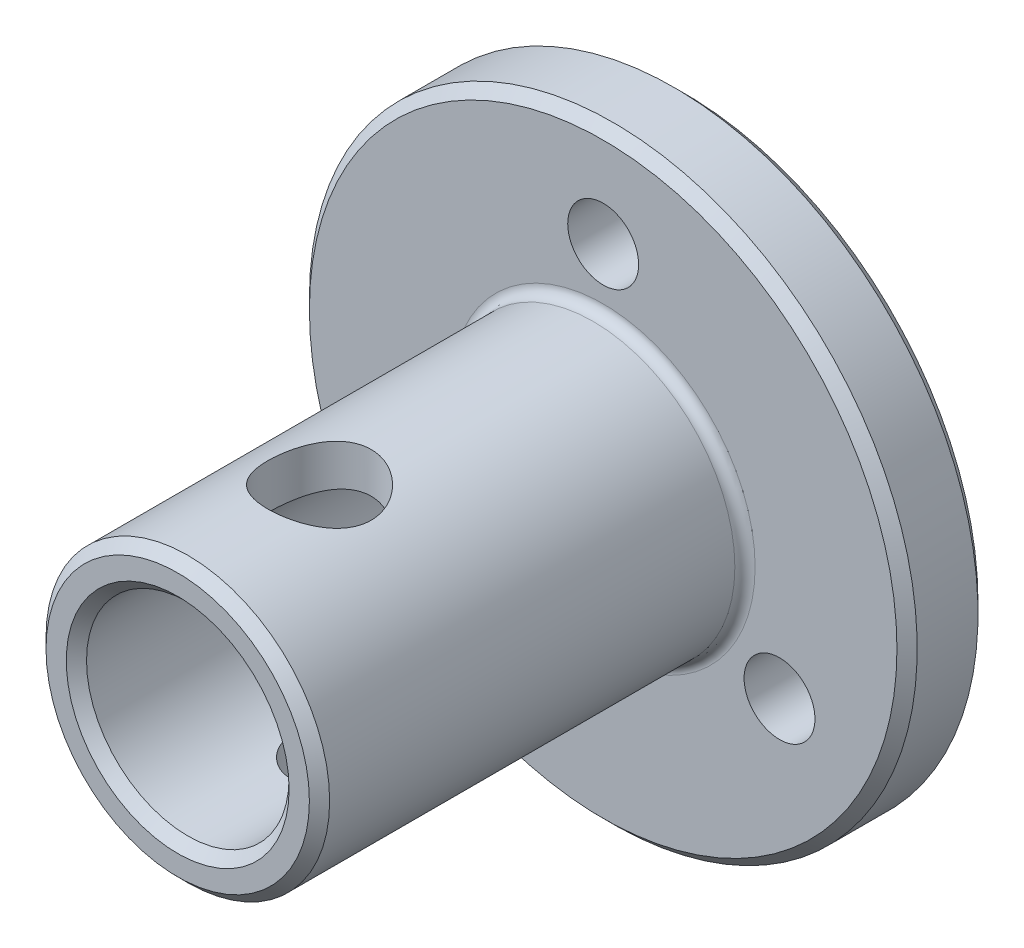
ISO-10303-21;
HEADER;
FILE_DESCRIPTION(('STEP AP214'),'2;1');
FILE_NAME('part.step','',(''),(''),'','','');
FILE_SCHEMA(('AUTOMOTIVE_DESIGN { 1 0 10303 214 1 1 1 1 }'));
ENDSEC;
DATA;
#1=APPLICATION_CONTEXT('core data for automotive mechanical design processes');
#2=APPLICATION_PROTOCOL_DEFINITION('international standard','automotive_design',2000,#1);
#3=PRODUCT_CONTEXT('',#1,'mechanical');
#4=PRODUCT('Part','Part','',(#3));
#5=PRODUCT_RELATED_PRODUCT_CATEGORY('part','',(#4));
#6=PRODUCT_DEFINITION_FORMATION('','',#4);
#7=PRODUCT_DEFINITION_CONTEXT('part definition',#1,'design');
#8=PRODUCT_DEFINITION('design','',#6,#7);
#9=PRODUCT_DEFINITION_SHAPE('','',#8);
#10=(LENGTH_UNIT() NAMED_UNIT(*) SI_UNIT(.MILLI.,.METRE.));
#11=(NAMED_UNIT(*) PLANE_ANGLE_UNIT() SI_UNIT($,.RADIAN.));
#12=(NAMED_UNIT(*) SI_UNIT($,.STERADIAN.) SOLID_ANGLE_UNIT());
#13=UNCERTAINTY_MEASURE_WITH_UNIT(LENGTH_MEASURE(1.E-05),#10,'distance_accuracy_value','');
#14=(GEOMETRIC_REPRESENTATION_CONTEXT(3) GLOBAL_UNCERTAINTY_ASSIGNED_CONTEXT((#13)) GLOBAL_UNIT_ASSIGNED_CONTEXT((#10,
#11,#12)) REPRESENTATION_CONTEXT('',''));
#15=CARTESIAN_POINT('',(0.,0.,0.));
#16=DIRECTION('',(0.,0.,1.));
#17=DIRECTION('',(1.,0.,0.));
#18=AXIS2_PLACEMENT_3D('',#15,#16,#17);
#19=CARTESIAN_POINT('',(0.,0.,42.));
#20=DIRECTION('',(0.,0.,-1.));
#21=DIRECTION('',(-1.,0.,0.));
#22=AXIS2_PLACEMENT_3D('',#19,#20,#21);
#23=CYLINDRICAL_SURFACE('',#22,14.);
#24=CARTESIAN_POINT('',(0.,0.,1.));
#25=DIRECTION('',(0.,0.,-1.));
#26=DIRECTION('',(-1.,0.,0.));
#27=AXIS2_PLACEMENT_3D('',#24,#25,#26);
#28=CIRCLE('',#27,14.);
#29=CARTESIAN_POINT('',(-14.,0.,1.));
#30=VERTEX_POINT('',#29);
#31=EDGE_CURVE('E163',#30,#30,#28,.F.);
#32=ORIENTED_EDGE('',*,*,#31,.T.);
#33=EDGE_LOOP('',(#32));
#34=FACE_BOUND('',#33,.T.);
#35=CARTESIAN_POINT('',(0.,14.,33.1));
#36=CARTESIAN_POINT('',(-0.138343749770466,14.0000003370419,33.1000004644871));
#37=CARTESIAN_POINT('',(-0.276680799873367,13.9979449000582,33.0943665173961));
#38=CARTESIAN_POINT('',(-0.552368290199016,13.9897787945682,33.0718853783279));
#39=CARTESIAN_POINT('',(-0.689718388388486,13.9836667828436,33.0550344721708));
#40=CARTESIAN_POINT('',(-0.962306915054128,13.9675552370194,33.0102927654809));
#41=CARTESIAN_POINT('',(-1.09754630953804,13.9575575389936,32.9824071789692));
#42=CARTESIAN_POINT('',(-1.36507143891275,13.9339378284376,32.9158509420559));
#43=CARTESIAN_POINT('',(-1.49735600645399,13.9203144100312,32.8771761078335));
#44=CARTESIAN_POINT('',(-1.75773259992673,13.8898347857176,32.7894881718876));
#45=CARTESIAN_POINT('',(-1.88583352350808,13.8729860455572,32.7404989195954));
#46=CARTESIAN_POINT('',(-2.1373595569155,13.8364693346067,32.6325431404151));
#47=CARTESIAN_POINT('',(-2.26078291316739,13.8168003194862,32.5735729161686));
#48=CARTESIAN_POINT('',(-2.62284632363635,13.7542885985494,32.3823543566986));
#49=CARTESIAN_POINT('',(-2.85348550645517,13.7079159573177,32.2357283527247));
#50=CARTESIAN_POINT('',(-3.29560951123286,13.6085389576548,31.9023758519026));
#51=CARTESIAN_POINT('',(-3.50609018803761,13.5553545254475,31.7143828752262));
#52=CARTESIAN_POINT('',(-3.89343927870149,13.4492184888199,31.306084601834));
#53=CARTESIAN_POINT('',(-4.07029822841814,13.3962669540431,31.0857702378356));
#54=CARTESIAN_POINT('',(-4.30961917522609,13.3204560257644,30.7310411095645));
#55=CARTESIAN_POINT('',(-4.38615151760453,13.2953868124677,30.6063628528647));
#56=CARTESIAN_POINT('',(-4.52838298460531,13.2476174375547,30.3505590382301));
#57=CARTESIAN_POINT('',(-4.59408643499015,13.2249163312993,30.2194360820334));
#58=CARTESIAN_POINT('',(-4.71411398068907,13.1826092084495,29.9515835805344));
#59=CARTESIAN_POINT('',(-4.76843655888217,13.1630036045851,29.8148532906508));
#60=CARTESIAN_POINT('',(-4.8651625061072,13.1275606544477,29.53682823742));
#61=CARTESIAN_POINT('',(-4.90757153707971,13.1117215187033,29.3955356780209));
#62=CARTESIAN_POINT('',(-4.9786550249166,13.0848913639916,29.1149536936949));
#63=CARTESIAN_POINT('',(-5.0077976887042,13.0737363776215,28.9757985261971));
#64=CARTESIAN_POINT('',(-5.05437706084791,13.0557993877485,28.6953206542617));
#65=CARTESIAN_POINT('',(-5.07181882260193,13.0490154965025,28.5539989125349));
#66=CARTESIAN_POINT('',(-5.09482227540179,13.0400513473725,28.2702636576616));
#67=CARTESIAN_POINT('',(-5.10038547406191,13.0378705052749,28.1278502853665));
#68=CARTESIAN_POINT('',(-5.09957306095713,13.03818835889,27.8430656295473));
#69=CARTESIAN_POINT('',(-5.09319787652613,13.0406868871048,27.7006943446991));
#70=CARTESIAN_POINT('',(-5.06927540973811,13.0500037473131,27.4251200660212));
#71=CARTESIAN_POINT('',(-5.05237650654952,13.0565712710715,27.2918516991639));
#72=CARTESIAN_POINT('',(-5.00817117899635,13.0735909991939,27.0272615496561));
#73=CARTESIAN_POINT('',(-4.98086128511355,13.0840444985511,26.8959404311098));
#74=CARTESIAN_POINT('',(-4.91609102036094,13.1085180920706,26.6361991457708));
#75=CARTESIAN_POINT('',(-4.87863334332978,13.1225372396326,26.5077782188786));
#76=CARTESIAN_POINT('',(-4.7938940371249,13.1537298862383,26.2545970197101));
#77=CARTESIAN_POINT('',(-4.74660864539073,13.1709045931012,26.1298381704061));
#78=CARTESIAN_POINT('',(-4.58868018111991,13.2271201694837,25.7578343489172));
#79=CARTESIAN_POINT('',(-4.46309366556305,13.2704030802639,25.5173763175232));
#80=CARTESIAN_POINT('',(-4.17626438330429,13.3634380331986,25.0603093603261));
#81=CARTESIAN_POINT('',(-4.015009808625,13.4131922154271,24.8437083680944));
#82=CARTESIAN_POINT('',(-3.64936945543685,13.5174115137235,24.4259446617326));
#83=CARTESIAN_POINT('',(-3.442903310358,13.5719757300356,24.2266201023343));
#84=CARTESIAN_POINT('',(-2.99883751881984,13.6769503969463,23.8649050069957));
#85=CARTESIAN_POINT('',(-2.76123361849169,13.7273602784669,23.7025195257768));
#86=CARTESIAN_POINT('',(-2.25715126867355,13.8192515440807,23.4174000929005));
#87=CARTESIAN_POINT('',(-1.99031831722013,13.8605995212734,23.2952467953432));
#88=CARTESIAN_POINT('',(-1.43801260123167,13.9287248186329,23.0981644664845));
#89=CARTESIAN_POINT('',(-1.15254768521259,13.9555082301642,23.0232156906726));
#90=CARTESIAN_POINT('',(-0.586595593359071,13.9904323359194,22.9261325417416));
#91=CARTESIAN_POINT('',(-0.306587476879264,13.9994478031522,22.9015175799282));
#92=CARTESIAN_POINT('',(0.253669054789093,14.000502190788,22.8986196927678));
#93=CARTESIAN_POINT('',(0.533917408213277,13.9925446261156,22.920327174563));
#94=CARTESIAN_POINT('',(1.07619281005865,13.9611248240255,23.007550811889));
#95=CARTESIAN_POINT('',(1.33851294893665,13.9382283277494,23.0714694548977));
#96=CARTESIAN_POINT('',(1.84854217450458,13.87979963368,23.2392230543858));
#97=CARTESIAN_POINT('',(2.09624935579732,13.8442657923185,23.3430632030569));
#98=CARTESIAN_POINT('',(2.57798477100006,13.7628272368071,23.5909788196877));
#99=CARTESIAN_POINT('',(2.811416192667,13.7166540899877,23.7361237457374));
#100=CARTESIAN_POINT('',(3.25135166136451,13.6190889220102,24.0612641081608));
#101=CARTESIAN_POINT('',(3.45784613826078,13.5676950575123,24.2412718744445));
#102=CARTESIAN_POINT('',(3.84994052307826,13.4618512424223,24.6427979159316));
#103=CARTESIAN_POINT('',(4.03378060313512,13.4073878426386,24.8660477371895));
#104=CARTESIAN_POINT('',(4.27959132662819,13.3301354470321,25.2222299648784));
#105=CARTESIAN_POINT('',(4.35657335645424,13.3051116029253,25.3445873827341));
#106=CARTESIAN_POINT('',(4.50002807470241,13.2572793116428,25.5957079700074));
#107=CARTESIAN_POINT('',(4.56650518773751,13.2344699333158,25.7244684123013));
#108=CARTESIAN_POINT('',(4.68857593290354,13.1917192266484,25.987936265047));
#109=CARTESIAN_POINT('',(4.74413957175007,13.1717858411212,26.1226588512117));
#110=CARTESIAN_POINT('',(4.84363717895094,13.1355237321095,26.3967468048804));
#111=CARTESIAN_POINT('',(4.88757605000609,13.1191934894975,26.5361101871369));
#112=CARTESIAN_POINT('',(4.96339846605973,13.090695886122,26.818459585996));
#113=CARTESIAN_POINT('',(4.99528519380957,13.0785274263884,26.9614446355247));
#114=CARTESIAN_POINT('',(5.04666865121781,13.0587861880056,27.2499349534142));
#115=CARTESIAN_POINT('',(5.06616617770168,13.0512131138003,27.3954400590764));
#116=CARTESIAN_POINT('',(5.09174147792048,13.0412554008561,27.678821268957));
#117=CARTESIAN_POINT('',(5.09856642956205,13.0385820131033,27.8166202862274));
#118=CARTESIAN_POINT('',(5.10102765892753,13.0376194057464,28.0923828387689));
#119=CARTESIAN_POINT('',(5.09666015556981,13.0393316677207,28.2303464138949));
#120=CARTESIAN_POINT('',(5.07677853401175,13.0470852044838,28.5052793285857));
#121=CARTESIAN_POINT('',(5.06126955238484,13.0531244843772,28.6422490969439));
#122=CARTESIAN_POINT('',(5.01926481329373,13.0693338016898,28.9142941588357));
#123=CARTESIAN_POINT('',(4.99276492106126,13.0795053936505,29.0493687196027));
#124=CARTESIAN_POINT('',(4.92991530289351,13.1033213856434,29.3129250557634));
#125=CARTESIAN_POINT('',(4.89385773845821,13.1168621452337,29.441485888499));
#126=CARTESIAN_POINT('',(4.811916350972,13.1471426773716,29.6950646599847));
#127=CARTESIAN_POINT('',(4.76602907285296,13.1638835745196,29.8200813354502));
#128=CARTESIAN_POINT('',(4.61415242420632,13.218215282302,30.1886216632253));
#129=CARTESIAN_POINT('',(4.4939002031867,13.2599342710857,30.4258352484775));
#130=CARTESIAN_POINT('',(4.21196042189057,13.352244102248,30.8890666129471));
#131=CARTESIAN_POINT('',(4.04849514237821,13.4031752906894,31.1139237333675));
#132=CARTESIAN_POINT('',(3.68738837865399,13.5069734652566,31.5340914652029));
#133=CARTESIAN_POINT('',(3.48973634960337,13.5598410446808,31.7293929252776));
#134=CARTESIAN_POINT('',(3.16596587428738,13.6378105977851,32.0009887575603));
#135=CARTESIAN_POINT('',(3.05040389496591,13.664184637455,32.0897811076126));
#136=CARTESIAN_POINT('',(2.81186933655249,13.7152556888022,32.2572993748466));
#137=CARTESIAN_POINT('',(2.68889951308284,13.7399533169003,32.3360290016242));
#138=CARTESIAN_POINT('',(2.43626756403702,13.7869909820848,32.4828520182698));
#139=CARTESIAN_POINT('',(2.30660252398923,13.8093299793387,32.5509407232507));
#140=CARTESIAN_POINT('',(2.04154935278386,13.8509949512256,32.6758450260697));
#141=CARTESIAN_POINT('',(1.90616372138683,13.8703222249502,32.7326654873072));
#142=CARTESIAN_POINT('',(1.62780595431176,13.9057658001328,32.8355666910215));
#143=CARTESIAN_POINT('',(1.48473596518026,13.9218096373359,32.8814082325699));
#144=CARTESIAN_POINT('',(1.19478351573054,13.9496843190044,32.9603484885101));
#145=CARTESIAN_POINT('',(1.04790272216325,13.9615169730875,32.9934526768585));
#146=CARTESIAN_POINT('',(0.751517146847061,13.9806033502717,33.0465716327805));
#147=CARTESIAN_POINT('',(0.602012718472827,13.9878576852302,33.0665881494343));
#148=CARTESIAN_POINT('',(0.301669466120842,13.9975556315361,33.0933015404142));
#149=CARTESIAN_POINT('',(0.150830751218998,13.9999996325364,33.099999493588));
#150=CARTESIAN_POINT('',(0.,14.,33.1));
#151=B_SPLINE_CURVE_WITH_KNOTS('',3,(#35,#36,#37,#38,#39,#40,#41,#42,#43,#44,#45,#46,#47,#48,
#49,#50,#51,#52,#53,#54,#55,#56,#57,#58,#59,#60,#61,#62,#63,#64,#65,#66,#67,#68,#69,#70,#71,#72,
#73,#74,#75,#76,#77,#78,#79,#80,#81,#82,#83,#84,#85,#86,#87,#88,#89,#90,#91,#92,#93,#94,#95,#96,
#97,#98,#99,#100,#101,#102,#103,#104,#105,#106,#107,#108,#109,#110,#111,#112,#113,#114,#115,
#116,#117,#118,#119,#120,#121,#122,#123,#124,#125,#126,#127,#128,#129,#130,#131,#132,#133,#134,
#135,#136,#137,#138,#139,#140,#141,#142,#143,#144,#145,#146,#147,#148,#149,#150),.UNSPECIFIED.,
.T.,.F.,(4,2,2,2,2,2,2,2,2,2,2,2,2,2,2,2,2,2,2,2,2,2,2,2,2,2,2,2,2,2,2,2,2,2,2,2,2,2,2,2,2,2,2,
2,2,2,2,2,2,2,2,2,2,2,2,2,2,4),(0.,0.414890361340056,0.829918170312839,1.24475010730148,
1.65974313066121,2.07378692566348,2.48798443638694,3.31573096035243,4.17363827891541,
5.03178673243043,5.47660769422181,5.92125053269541,6.36595260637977,6.8104429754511,
7.23772329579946,7.66481896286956,8.09186042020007,8.5188865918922,8.92190054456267,
9.32504892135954,9.72809038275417,10.13128643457,10.9515386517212,11.7720628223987,
12.6443923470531,13.5168411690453,14.4013799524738,15.2855485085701,16.1249766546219,
16.9642309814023,17.7734151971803,18.5827046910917,19.4152263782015,20.2480430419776,
21.126396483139,21.5660941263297,22.005606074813,22.4463095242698,22.8868268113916,
23.3272276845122,23.7676002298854,24.1810652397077,24.5946699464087,25.0080840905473,
25.4216539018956,25.8238048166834,26.2260973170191,27.0300708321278,27.8744231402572,
28.7190363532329,29.1628969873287,29.6065935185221,30.0504848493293,30.4941841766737,
30.9468146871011,31.3992504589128,31.8516257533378,32.3039644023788),.UNSPECIFIED.);
#152=CARTESIAN_POINT('',(0.,14.,33.1));
#153=VERTEX_POINT('',#152);
#154=EDGE_CURVE('E181',#153,#153,#151,.T.);
#155=ORIENTED_EDGE('',*,*,#154,.T.);
#156=EDGE_LOOP('',(#155));
#157=FACE_BOUND('',#156,.T.);
#158=CARTESIAN_POINT('',(0.,-14.,31.));
#159=CARTESIAN_POINT('',(0.166471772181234,-13.9999969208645,30.9999942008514));
#160=CARTESIAN_POINT('',(0.33301439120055,-13.9970005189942,30.9860967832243));
#161=CARTESIAN_POINT('',(0.661374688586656,-13.9853365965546,30.9309286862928));
#162=CARTESIAN_POINT('',(0.823188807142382,-13.976664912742,30.8896379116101));
#163=CARTESIAN_POINT('',(1.13729864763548,-13.9546166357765,30.7810312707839));
#164=CARTESIAN_POINT('',(1.28960392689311,-13.9412448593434,30.7137420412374));
#165=CARTESIAN_POINT('',(1.58075635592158,-13.9112421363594,30.5551318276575));
#166=CARTESIAN_POINT('',(1.71960396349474,-13.8946113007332,30.4638116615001));
#167=CARTESIAN_POINT('',(1.98204958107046,-13.8596273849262,30.258239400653));
#168=CARTESIAN_POINT('',(2.10541006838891,-13.8412536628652,30.143687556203));
#169=CARTESIAN_POINT('',(2.3313208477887,-13.8050013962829,29.8955473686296));
#170=CARTESIAN_POINT('',(2.43386934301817,-13.7871228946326,29.7619573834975));
#171=CARTESIAN_POINT('',(2.61628408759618,-13.7536823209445,29.4777884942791));
#172=CARTESIAN_POINT('',(2.69589916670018,-13.7381467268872,29.3270449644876));
#173=CARTESIAN_POINT('',(2.82857647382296,-13.7114465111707,29.0139310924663));
#174=CARTESIAN_POINT('',(2.88164174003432,-13.7002813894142,28.8515620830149));
#175=CARTESIAN_POINT('',(2.9589314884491,-13.6837961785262,28.5223778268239));
#176=CARTESIAN_POINT('',(2.98357559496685,-13.6783911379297,28.3556654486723));
#177=CARTESIAN_POINT('',(3.00462790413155,-13.6737827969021,28.020391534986));
#178=CARTESIAN_POINT('',(3.00103943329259,-13.6745787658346,27.8518302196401));
#179=CARTESIAN_POINT('',(2.96606652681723,-13.6822055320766,27.5207506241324));
#180=CARTESIAN_POINT('',(2.93516797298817,-13.6889308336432,27.3581782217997));
#181=CARTESIAN_POINT('',(2.84722108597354,-13.7074918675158,27.0405795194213));
#182=CARTESIAN_POINT('',(2.79017133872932,-13.719327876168,26.8855536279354));
#183=CARTESIAN_POINT('',(2.65109102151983,-13.7468816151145,26.5860742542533));
#184=CARTESIAN_POINT('',(2.5688722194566,-13.7626284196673,26.4417109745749));
#185=CARTESIAN_POINT('',(2.38192014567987,-13.7962114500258,26.1686496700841));
#186=CARTESIAN_POINT('',(2.27718392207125,-13.8140479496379,26.0399537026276));
#187=CARTESIAN_POINT('',(2.04559085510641,-13.8502543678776,25.7990812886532));
#188=CARTESIAN_POINT('',(1.91832046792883,-13.8686276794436,25.6873025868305));
#189=CARTESIAN_POINT('',(1.6466346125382,-13.9035003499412,25.4866125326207));
#190=CARTESIAN_POINT('',(1.50221885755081,-13.9199996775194,25.3977015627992));
#191=CARTESIAN_POINT('',(1.19986692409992,-13.9493155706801,25.2451786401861));
#192=CARTESIAN_POINT('',(1.04190451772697,-13.9621247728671,25.181617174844));
#193=CARTESIAN_POINT('',(0.717206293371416,-13.9825621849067,25.0820487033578));
#194=CARTESIAN_POINT('',(0.55047170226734,-13.9901911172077,25.0460378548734));
#195=CARTESIAN_POINT('',(0.216375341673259,-13.9993061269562,25.0031675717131));
#196=CARTESIAN_POINT('',(0.0490863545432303,-14.0009067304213,24.9957645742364));
#197=CARTESIAN_POINT('',(-0.284337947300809,-13.9981049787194,25.0088491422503));
#198=CARTESIAN_POINT('',(-0.45047333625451,-13.993703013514,25.0293348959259));
#199=CARTESIAN_POINT('',(-0.775085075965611,-13.9794628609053,25.0971644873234));
#200=CARTESIAN_POINT('',(-0.933623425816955,-13.9696821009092,25.1442247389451));
#201=CARTESIAN_POINT('',(-1.24055690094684,-13.9457784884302,25.2635538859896));
#202=CARTESIAN_POINT('',(-1.38895118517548,-13.9316552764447,25.3358248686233));
#203=CARTESIAN_POINT('',(-1.67364279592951,-13.900350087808,25.5046670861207));
#204=CARTESIAN_POINT('',(-1.80974515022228,-13.8831286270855,25.6015595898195));
#205=CARTESIAN_POINT('',(-2.0639538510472,-13.8476206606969,25.8164696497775));
#206=CARTESIAN_POINT('',(-2.182057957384,-13.8293340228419,25.9344898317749));
#207=CARTESIAN_POINT('',(-2.39905422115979,-13.7933634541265,26.1907947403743));
#208=CARTESIAN_POINT('',(-2.49757074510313,-13.7756958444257,26.3294001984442));
#209=CARTESIAN_POINT('',(-2.66992830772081,-13.7433330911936,26.621509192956));
#210=CARTESIAN_POINT('',(-2.74377039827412,-13.7286378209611,26.775012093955));
#211=CARTESIAN_POINT('',(-2.86419482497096,-13.7040201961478,27.0917445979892));
#212=CARTESIAN_POINT('',(-2.91092797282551,-13.6940714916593,27.2549147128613));
#213=CARTESIAN_POINT('',(-2.97625392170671,-13.6800237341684,27.5870311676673));
#214=CARTESIAN_POINT('',(-2.99485101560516,-13.6759237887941,27.7559766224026));
#215=CARTESIAN_POINT('',(-3.00319999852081,-13.6740923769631,28.0910646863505));
#216=CARTESIAN_POINT('',(-2.99354694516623,-13.6762295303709,28.2571920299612));
#217=CARTESIAN_POINT('',(-2.94699578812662,-13.6863352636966,28.5853944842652));
#218=CARTESIAN_POINT('',(-2.91009797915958,-13.6943037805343,28.7474696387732));
#219=CARTESIAN_POINT('',(-2.81038691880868,-13.7151116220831,29.0625173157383));
#220=CARTESIAN_POINT('',(-2.74765694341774,-13.7279352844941,29.2155172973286));
#221=CARTESIAN_POINT('',(-2.59813503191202,-13.757015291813,29.5089107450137));
#222=CARTESIAN_POINT('',(-2.51134070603,-13.7732719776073,29.6493029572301));
#223=CARTESIAN_POINT('',(-2.31416580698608,-13.8077811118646,29.9164363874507));
#224=CARTESIAN_POINT('',(-2.20335974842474,-13.8260661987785,30.042859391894));
#225=CARTESIAN_POINT('',(-1.96217310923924,-13.8623489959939,30.2755125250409));
#226=CARTESIAN_POINT('',(-1.8317880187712,-13.8803466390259,30.3817379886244));
#227=CARTESIAN_POINT('',(-1.55320629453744,-13.9142898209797,30.5722319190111));
#228=CARTESIAN_POINT('',(-1.40480969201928,-13.9302072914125,30.656213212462));
#229=CARTESIAN_POINT('',(-1.0957003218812,-13.9579165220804,30.7979090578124));
#230=CARTESIAN_POINT('',(-0.934998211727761,-13.9697118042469,30.8556460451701));
#231=CARTESIAN_POINT('',(-0.645070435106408,-13.9856969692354,30.9327043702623));
#232=CARTESIAN_POINT('',(-0.517434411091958,-13.9910278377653,30.9578928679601));
#233=CARTESIAN_POINT('',(-0.259879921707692,-13.9981804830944,30.9915426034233));
#234=CARTESIAN_POINT('',(-0.129961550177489,-14.0000024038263,31.0000045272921));
#235=CARTESIAN_POINT('',(0.,-14.,31.));
#236=B_SPLINE_CURVE_WITH_KNOTS('',3,(#158,#159,#160,#161,#162,#163,#164,#165,#166,#167,#168,
#169,#170,#171,#172,#173,#174,#175,#176,#177,#178,#179,#180,#181,#182,#183,#184,#185,#186,#187,
#188,#189,#190,#191,#192,#193,#194,#195,#196,#197,#198,#199,#200,#201,#202,#203,#204,#205,#206,
#207,#208,#209,#210,#211,#212,#213,#214,#215,#216,#217,#218,#219,#220,#221,#222,#223,#224,#225,
#226,#227,#228,#229,#230,#231,#232,#233,#234,#235),.UNSPECIFIED.,.T.,.F.,(4,2,2,2,2,2,2,2,2,2,2,
2,2,2,2,2,2,2,2,2,2,2,2,2,2,2,2,2,2,2,2,2,2,2,2,2,2,2,4),(0.,0.498939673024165,
0.998245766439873,1.49704164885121,1.99582055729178,2.50149923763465,3.00722155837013,
3.51828858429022,4.0292971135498,4.53266016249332,5.03596390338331,5.53048950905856,
6.02504185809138,6.52338712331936,7.0217977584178,7.53054022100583,8.03929119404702,
8.54905042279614,9.05873854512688,9.55869331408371,10.0586156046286,10.5533012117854,
11.0480277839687,11.5495746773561,12.0511839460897,12.5616412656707,13.0720768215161,
13.5796448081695,14.0871353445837,14.5840136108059,15.0808865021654,15.5761699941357,
16.0715026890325,16.5764590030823,17.0815318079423,17.5928382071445,18.1037066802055,
18.4932359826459,18.8827493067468),.UNSPECIFIED.);
#237=CARTESIAN_POINT('',(0.,-14.,31.));
#238=VERTEX_POINT('',#237);
#239=EDGE_CURVE('E182',#238,#238,#236,.T.);
#240=ORIENTED_EDGE('',*,*,#239,.T.);
#241=EDGE_LOOP('',(#240));
#242=FACE_BOUND('',#241,.T.);
#243=CARTESIAN_POINT('',(0.,0.,41.));
#244=DIRECTION('',(0.,0.,1.));
#245=DIRECTION('',(1.,0.,0.));
#246=AXIS2_PLACEMENT_3D('',#243,#244,#245);
#247=CIRCLE('',#246,14.);
#248=CARTESIAN_POINT('',(14.,0.,41.));
#249=VERTEX_POINT('',#248);
#250=EDGE_CURVE('E245',#249,#249,#247,.F.);
#251=ORIENTED_EDGE('',*,*,#250,.T.);
#252=EDGE_LOOP('',(#251));
#253=FACE_BOUND('',#252,.T.);
#254=ADVANCED_FACE('F156',(#34,#157,#242,#253),#23,.T.);
#255=CARTESIAN_POINT('',(0.,0.,42.));
#256=DIRECTION('',(0.,0.,1.));
#257=DIRECTION('',(1.,0.,0.));
#258=AXIS2_PLACEMENT_3D('',#255,#256,#257);
#259=PLANE('',#258);
#260=CARTESIAN_POINT('',(0.,0.,42.));
#261=DIRECTION('',(0.,0.,1.));
#262=DIRECTION('',(1.,0.,0.));
#263=AXIS2_PLACEMENT_3D('',#260,#261,#262);
#264=CIRCLE('',#263,13.);
#265=CARTESIAN_POINT('',(13.,0.,42.));
#266=VERTEX_POINT('',#265);
#267=EDGE_CURVE('E242',#266,#266,#264,.T.);
#268=ORIENTED_EDGE('',*,*,#267,.T.);
#269=EDGE_LOOP('',(#268));
#270=FACE_BOUND('',#269,.T.);
#271=CARTESIAN_POINT('',(0.,0.,42.));
#272=DIRECTION('',(0.,0.,1.));
#273=DIRECTION('',(1.,0.,0.));
#274=AXIS2_PLACEMENT_3D('',#271,#272,#273);
#275=CIRCLE('',#274,11.);
#276=CARTESIAN_POINT('',(11.,0.,42.));
#277=VERTEX_POINT('',#276);
#278=EDGE_CURVE('E236',#277,#277,#275,.F.);
#279=ORIENTED_EDGE('',*,*,#278,.T.);
#280=EDGE_LOOP('',(#279));
#281=FACE_BOUND('',#280,.T.);
#282=ADVANCED_FACE('F270',(#270,#281),#259,.T.);
#283=CARTESIAN_POINT('',(0.,0.,-8.));
#284=DIRECTION('',(0.,0.,1.));
#285=DIRECTION('',(1.,0.,0.));
#286=AXIS2_PLACEMENT_3D('',#283,#284,#285);
#287=CYLINDRICAL_SURFACE('',#286,30.);
#288=CARTESIAN_POINT('',(0.,0.,-1.00000000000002));
#289=DIRECTION('',(0.,0.,-1.));
#290=DIRECTION('',(-1.,0.,0.));
#291=AXIS2_PLACEMENT_3D('',#288,#289,#290);
#292=CIRCLE('',#291,30.);
#293=CARTESIAN_POINT('',(-30.,0.,-1.00000000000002));
#294=VERTEX_POINT('',#293);
#295=EDGE_CURVE('E171',#294,#294,#292,.T.);
#296=ORIENTED_EDGE('',*,*,#295,.T.);
#297=EDGE_LOOP('',(#296));
#298=FACE_BOUND('',#297,.T.);
#299=CARTESIAN_POINT('',(0.,0.,-6.99999999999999));
#300=DIRECTION('',(0.,0.,-1.));
#301=DIRECTION('',(-1.,0.,0.));
#302=AXIS2_PLACEMENT_3D('',#299,#300,#301);
#303=CIRCLE('',#302,30.);
#304=CARTESIAN_POINT('',(-30.,0.,-6.99999999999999));
#305=VERTEX_POINT('',#304);
#306=EDGE_CURVE('E239',#305,#305,#303,.F.);
#307=ORIENTED_EDGE('',*,*,#306,.T.);
#308=EDGE_LOOP('',(#307));
#309=FACE_BOUND('',#308,.T.);
#310=ADVANCED_FACE('F274',(#298,#309),#287,.T.);
#311=CARTESIAN_POINT('',(0.,0.,-8.));
#312=DIRECTION('',(0.,0.,-1.));
#313=DIRECTION('',(-1.,0.,0.));
#314=AXIS2_PLACEMENT_3D('',#311,#312,#313);
#315=PLANE('',#314);
#316=CARTESIAN_POINT('',(-17.4071106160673,-10.0499999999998,-8.));
#317=DIRECTION('',(0.,0.,-1.));
#318=DIRECTION('',(0.499999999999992,-0.866025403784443,0.));
#319=AXIS2_PLACEMENT_3D('',#316,#317,#318);
#320=CIRCLE('',#319,3.5);
#321=CARTESIAN_POINT('',(-15.6571106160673,-13.0810889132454,-8.));
#322=VERTEX_POINT('',#321);
#323=EDGE_CURVE('E210',#322,#322,#320,.T.);
#324=ORIENTED_EDGE('',*,*,#323,.F.);
#325=EDGE_LOOP('',(#324));
#326=FACE_BOUND('',#325,.T.);
#327=CARTESIAN_POINT('',(17.4071106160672,-10.0500000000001,-8.));
#328=DIRECTION('',(0.,0.,-1.));
#329=DIRECTION('',(0.500000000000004,0.866025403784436,0.));
#330=AXIS2_PLACEMENT_3D('',#327,#328,#329);
#331=CIRCLE('',#330,3.5);
#332=CARTESIAN_POINT('',(19.1571106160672,-7.01891108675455,-8.));
#333=VERTEX_POINT('',#332);
#334=EDGE_CURVE('E216',#333,#333,#331,.T.);
#335=ORIENTED_EDGE('',*,*,#334,.F.);
#336=EDGE_LOOP('',(#335));
#337=FACE_BOUND('',#336,.T.);
#338=CARTESIAN_POINT('',(0.,20.1,-8.));
#339=DIRECTION('',(0.,0.,-1.));
#340=DIRECTION('',(-1.,0.,0.));
#341=AXIS2_PLACEMENT_3D('',#338,#339,#340);
#342=CIRCLE('',#341,3.5);
#343=CARTESIAN_POINT('',(-3.5,20.1,-8.));
#344=VERTEX_POINT('',#343);
#345=EDGE_CURVE('E220',#344,#344,#342,.T.);
#346=ORIENTED_EDGE('',*,*,#345,.F.);
#347=EDGE_LOOP('',(#346));
#348=FACE_BOUND('',#347,.T.);
#349=CARTESIAN_POINT('',(0.,0.,-8.));
#350=DIRECTION('',(0.,0.,-1.));
#351=DIRECTION('',(-1.,0.,0.));
#352=AXIS2_PLACEMENT_3D('',#349,#350,#351);
#353=CIRCLE('',#352,11.);
#354=CARTESIAN_POINT('',(-11.,0.,-8.));
#355=VERTEX_POINT('',#354);
#356=EDGE_CURVE('E233',#355,#355,#353,.F.);
#357=ORIENTED_EDGE('',*,*,#356,.T.);
#358=EDGE_LOOP('',(#357));
#359=FACE_BOUND('',#358,.T.);
#360=CARTESIAN_POINT('',(0.,0.,-8.));
#361=DIRECTION('',(0.,0.,-1.));
#362=DIRECTION('',(-1.,0.,0.));
#363=AXIS2_PLACEMENT_3D('',#360,#361,#362);
#364=CIRCLE('',#363,29.);
#365=CARTESIAN_POINT('',(-29.,0.,-8.));
#366=VERTEX_POINT('',#365);
#367=EDGE_CURVE('E230',#366,#366,#364,.T.);
#368=ORIENTED_EDGE('',*,*,#367,.T.);
#369=EDGE_LOOP('',(#368));
#370=FACE_BOUND('',#369,.T.);
#371=ADVANCED_FACE('F321',(#326,#337,#348,#359,#370),#315,.T.);
#372=CARTESIAN_POINT('',(0.,0.,0.));
#373=DIRECTION('',(0.,0.,-1.));
#374=DIRECTION('',(-1.,0.,0.));
#375=AXIS2_PLACEMENT_3D('',#372,#373,#374);
#376=PLANE('',#375);
#377=CARTESIAN_POINT('',(0.,0.,0.));
#378=DIRECTION('',(0.,0.,-1.));
#379=DIRECTION('',(-1.,0.,0.));
#380=AXIS2_PLACEMENT_3D('',#377,#378,#379);
#381=CIRCLE('',#380,15.);
#382=CARTESIAN_POINT('',(-15.,0.,0.));
#383=VERTEX_POINT('',#382);
#384=EDGE_CURVE('E11',#383,#383,#381,.T.);
#385=ORIENTED_EDGE('',*,*,#384,.T.);
#386=EDGE_LOOP('',(#385));
#387=FACE_BOUND('',#386,.T.);
#388=CARTESIAN_POINT('',(-17.4071106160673,-10.0499999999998,0.));
#389=DIRECTION('',(0.,0.,-1.));
#390=DIRECTION('',(-1.,0.,0.));
#391=AXIS2_PLACEMENT_3D('',#388,#389,#390);
#392=CIRCLE('',#391,3.5);
#393=CARTESIAN_POINT('',(-20.9071106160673,-10.0499999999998,0.));
#394=VERTEX_POINT('',#393);
#395=EDGE_CURVE('E215',#394,#394,#392,.T.);
#396=ORIENTED_EDGE('',*,*,#395,.T.);
#397=EDGE_LOOP('',(#396));
#398=FACE_BOUND('',#397,.T.);
#399=CARTESIAN_POINT('',(17.4071106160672,-10.0500000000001,0.));
#400=DIRECTION('',(0.,0.,-1.));
#401=DIRECTION('',(-1.,0.,0.));
#402=AXIS2_PLACEMENT_3D('',#399,#400,#401);
#403=CIRCLE('',#402,3.5);
#404=CARTESIAN_POINT('',(13.9071106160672,-10.0500000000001,0.));
#405=VERTEX_POINT('',#404);
#406=EDGE_CURVE('E219',#405,#405,#403,.T.);
#407=ORIENTED_EDGE('',*,*,#406,.T.);
#408=EDGE_LOOP('',(#407));
#409=FACE_BOUND('',#408,.T.);
#410=CARTESIAN_POINT('',(0.,20.1,0.));
#411=DIRECTION('',(0.,0.,-1.));
#412=DIRECTION('',(-1.,0.,0.));
#413=AXIS2_PLACEMENT_3D('',#410,#411,#412);
#414=CIRCLE('',#413,3.5);
#415=CARTESIAN_POINT('',(-3.5,20.1,0.));
#416=VERTEX_POINT('',#415);
#417=EDGE_CURVE('E223',#416,#416,#414,.T.);
#418=ORIENTED_EDGE('',*,*,#417,.T.);
#419=EDGE_LOOP('',(#418));
#420=FACE_BOUND('',#419,.T.);
#421=CARTESIAN_POINT('',(0.,0.,0.));
#422=DIRECTION('',(0.,0.,-1.));
#423=DIRECTION('',(-1.,0.,0.));
#424=AXIS2_PLACEMENT_3D('',#421,#422,#423);
#425=CIRCLE('',#424,29.);
#426=CARTESIAN_POINT('',(-29.,0.,0.));
#427=VERTEX_POINT('',#426);
#428=EDGE_CURVE('E167',#427,#427,#425,.F.);
#429=ORIENTED_EDGE('',*,*,#428,.T.);
#430=EDGE_LOOP('',(#429));
#431=FACE_BOUND('',#430,.T.);
#432=ADVANCED_FACE('F256',(#387,#398,#409,#420,#431),#376,.F.);
#433=CARTESIAN_POINT('',(0.,0.,42.));
#434=DIRECTION('',(0.,0.,-1.));
#435=DIRECTION('',(-1.,0.,0.));
#436=AXIS2_PLACEMENT_3D('',#433,#434,#435);
#437=CYLINDRICAL_SURFACE('',#436,10.);
#438=CARTESIAN_POINT('',(0.,10.,33.1));
#439=CARTESIAN_POINT('',(0.133793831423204,9.99999980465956,33.0999998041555));
#440=CARTESIAN_POINT('',(0.267592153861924,9.99730878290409,33.0947291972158));
#441=CARTESIAN_POINT('',(0.534199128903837,9.9866130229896,33.0737087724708));
#442=CARTESIAN_POINT('',(0.6670073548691,9.97860611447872,33.0579546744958));
#443=CARTESIAN_POINT('',(0.930755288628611,9.95747059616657,33.0161286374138));
#444=CARTESIAN_POINT('',(1.06169225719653,9.94433514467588,32.9900429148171));
#445=CARTESIAN_POINT('',(1.32063120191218,9.91327133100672,32.9278467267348));
#446=CARTESIAN_POINT('',(1.44863195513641,9.89534100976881,32.8917321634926));
#447=CARTESIAN_POINT('',(1.7002554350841,9.85521616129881,32.8100464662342));
#448=CARTESIAN_POINT('',(1.8238949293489,9.83304071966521,32.7645175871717));
#449=CARTESIAN_POINT('',(2.06667845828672,9.78489593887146,32.6643444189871));
#450=CARTESIAN_POINT('',(2.18582077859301,9.75892517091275,32.6096966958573));
#451=CARTESIAN_POINT('',(2.53539554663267,9.67620451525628,32.4328166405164));
#452=CARTESIAN_POINT('',(2.75824625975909,9.61460123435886,32.2975586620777));
#453=CARTESIAN_POINT('',(3.19236440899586,9.47965013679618,31.9867942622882));
#454=CARTESIAN_POINT('',(3.40204917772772,9.40581014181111,31.8093076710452));
#455=CARTESIAN_POINT('',(3.79015487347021,9.25624228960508,31.4234097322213));
#456=CARTESIAN_POINT('',(3.96855093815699,9.18051298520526,31.2149740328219));
#457=CARTESIAN_POINT('',(4.30366061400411,9.02857070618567,30.7525202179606));
#458=CARTESIAN_POINT('',(4.45742168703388,8.95282143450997,30.4961715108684));
#459=CARTESIAN_POINT('',(4.65352994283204,8.8515584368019,30.0921630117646));
#460=CARTESIAN_POINT('',(4.71315792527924,8.81985574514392,29.9541966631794));
#461=CARTESIAN_POINT('',(4.82028187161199,8.7617689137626,29.6725823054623));
#462=CARTESIAN_POINT('',(4.86778514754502,8.73538157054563,29.5289377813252));
#463=CARTESIAN_POINT('',(4.94754661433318,8.69044036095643,29.2458315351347));
#464=CARTESIAN_POINT('',(4.9805510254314,8.67151024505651,29.106639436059));
#465=CARTESIAN_POINT('',(5.03481223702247,8.64011875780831,28.825328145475));
#466=CARTESIAN_POINT('',(5.05607539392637,8.62765388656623,28.6832105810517));
#467=CARTESIAN_POINT('',(5.08652827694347,8.60973543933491,28.3973405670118));
#468=CARTESIAN_POINT('',(5.09572598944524,8.6042772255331,28.2535892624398));
#469=CARTESIAN_POINT('',(5.10191567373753,8.60060883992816,27.9657381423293));
#470=CARTESIAN_POINT('',(5.09890889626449,8.60239792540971,27.8216383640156));
#471=CARTESIAN_POINT('',(5.08189398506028,8.61245778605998,27.5525988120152));
#472=CARTESIAN_POINT('',(5.06932020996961,8.61988319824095,27.4275332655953));
#473=CARTESIAN_POINT('',(5.03505362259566,8.63994384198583,27.1790430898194));
#474=CARTESIAN_POINT('',(5.01335796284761,8.65258070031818,27.0556189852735));
#475=CARTESIAN_POINT('',(4.96110189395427,8.68264789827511,26.8112728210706));
#476=CARTESIAN_POINT('',(4.93054240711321,8.70007773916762,26.6903505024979));
#477=CARTESIAN_POINT('',(4.86088255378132,8.73918822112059,26.4516786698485));
#478=CARTESIAN_POINT('',(4.8217788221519,8.76087053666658,26.3339304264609));
#479=CARTESIAN_POINT('',(4.69020336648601,8.83244839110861,25.9811280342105));
#480=CARTESIAN_POINT('',(4.58464459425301,8.8881610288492,25.7519835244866));
#481=CARTESIAN_POINT('',(4.34239959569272,9.00898628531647,25.3136591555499));
#482=CARTESIAN_POINT('',(4.20569937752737,9.07410312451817,25.1044883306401));
#483=CARTESIAN_POINT('',(3.8839296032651,9.21683395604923,24.6827033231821));
#484=CARTESIAN_POINT('',(3.69484948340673,9.29495999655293,24.4733118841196));
#485=CARTESIAN_POINT('',(3.28386524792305,9.44797308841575,24.0877674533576));
#486=CARTESIAN_POINT('',(3.0619443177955,9.52285845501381,23.9116315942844));
#487=CARTESIAN_POINT('',(2.70198547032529,9.62891878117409,23.6720083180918));
#488=CARTESIAN_POINT('',(2.57408511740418,9.66397937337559,23.5947152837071));
#489=CARTESIAN_POINT('',(2.31122235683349,9.73018910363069,23.451303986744));
#490=CARTESIAN_POINT('',(2.17626296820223,9.76133989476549,23.3851809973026));
#491=CARTESIAN_POINT('',(1.90022060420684,9.81881030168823,23.2648306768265));
#492=CARTESIAN_POINT('',(1.7591402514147,9.84513196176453,23.2105983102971));
#493=CARTESIAN_POINT('',(1.47187264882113,9.89215649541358,23.1146636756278));
#494=CARTESIAN_POINT('',(1.32568601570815,9.91286004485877,23.072959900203));
#495=CARTESIAN_POINT('',(1.04205474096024,9.94649450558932,23.0056505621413));
#496=CARTESIAN_POINT('',(0.904923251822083,9.95993651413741,22.9789779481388));
#497=CARTESIAN_POINT('',(0.628510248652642,9.98119138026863,22.9369464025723));
#498=CARTESIAN_POINT('',(0.489228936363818,9.98900476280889,22.9215864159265));
#499=CARTESIAN_POINT('',(0.209726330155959,9.99877804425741,22.9023897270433));
#500=CARTESIAN_POINT('',(0.0695054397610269,10.0007403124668,22.898548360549));
#501=CARTESIAN_POINT('',(-0.210730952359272,9.99876106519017,22.9024293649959));
#502=CARTESIAN_POINT('',(-0.35074646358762,9.99481983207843,22.9101511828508));
#503=CARTESIAN_POINT('',(-0.617995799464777,9.98170806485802,22.935949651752));
#504=CARTESIAN_POINT('',(-0.745339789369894,9.97299078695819,22.9531293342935));
#505=CARTESIAN_POINT('',(-0.998014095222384,9.95088226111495,22.9969593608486));
#506=CARTESIAN_POINT('',(-1.12334376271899,9.93748953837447,23.0236126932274));
#507=CARTESIAN_POINT('',(-1.37109847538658,9.90634471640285,23.0861012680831));
#508=CARTESIAN_POINT('',(-1.49352440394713,9.88859396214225,23.1219336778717));
#509=CARTESIAN_POINT('',(-1.73479856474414,9.84913465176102,23.2024303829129));
#510=CARTESIAN_POINT('',(-1.85364540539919,9.8274245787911,23.2470980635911));
#511=CARTESIAN_POINT('',(-2.21016905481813,9.75575598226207,23.3964556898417));
#512=CARTESIAN_POINT('',(-2.44115664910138,9.70012931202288,23.5148111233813));
#513=CARTESIAN_POINT('',(-2.88061156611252,9.57884325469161,23.7835348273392));
#514=CARTESIAN_POINT('',(-3.08906943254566,9.51317968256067,23.9339164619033));
#515=CARTESIAN_POINT('',(-3.50007272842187,9.37024254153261,24.2799500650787));
#516=CARTESIAN_POINT('',(-3.6998868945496,9.29246646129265,24.4786426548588));
#517=CARTESIAN_POINT('',(-4.0646869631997,9.13879483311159,24.9068737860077));
#518=CARTESIAN_POINT('',(-4.22964635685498,9.06290075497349,25.1364355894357));
#519=CARTESIAN_POINT('',(-4.45164675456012,8.95489435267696,25.5069846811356));
#520=CARTESIAN_POINT('',(-4.52285398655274,8.91903722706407,25.6385803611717));
#521=CARTESIAN_POINT('',(-4.65376294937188,8.85143551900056,25.9083643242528));
#522=CARTESIAN_POINT('',(-4.71346989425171,8.81968907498,26.0465495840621));
#523=CARTESIAN_POINT('',(-4.82067713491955,8.76155207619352,26.328531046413));
#524=CARTESIAN_POINT('',(-4.86818783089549,8.73515696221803,26.4723223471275));
#525=CARTESIAN_POINT('',(-4.95041813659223,8.68882010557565,26.7645314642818));
#526=CARTESIAN_POINT('',(-4.9851398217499,8.66887731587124,26.9129485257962));
#527=CARTESIAN_POINT('',(-5.03851366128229,8.63795316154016,27.1985098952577));
#528=CARTESIAN_POINT('',(-5.05839810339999,8.62629004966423,27.3353507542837));
#529=CARTESIAN_POINT('',(-5.08699256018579,8.60945908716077,27.6105864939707));
#530=CARTESIAN_POINT('',(-5.09570385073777,8.6042904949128,27.7489811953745));
#531=CARTESIAN_POINT('',(-5.10181496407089,8.60066838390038,28.0260520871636));
#532=CARTESIAN_POINT('',(-5.09921931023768,8.60221217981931,28.1647281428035));
#533=CARTESIAN_POINT('',(-5.08276916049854,8.61194219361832,28.4411685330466));
#534=CARTESIAN_POINT('',(-5.06891519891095,8.62012809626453,28.5789329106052));
#535=CARTESIAN_POINT('',(-5.03216259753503,8.64162830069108,28.838257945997));
#536=CARTESIAN_POINT('',(-5.01034395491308,8.65432672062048,28.9600245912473));
#537=CARTESIAN_POINT('',(-4.95807903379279,8.68437401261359,29.2011193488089));
#538=CARTESIAN_POINT('',(-4.92763010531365,8.70172431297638,29.3204467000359));
#539=CARTESIAN_POINT('',(-4.82378603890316,8.75999153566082,29.6736866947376));
#540=CARTESIAN_POINT('',(-4.73787049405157,8.80713912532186,29.9030172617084));
#541=CARTESIAN_POINT('',(-4.52880779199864,8.91653771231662,30.3594881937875));
#542=CARTESIAN_POINT('',(-4.40355692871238,8.97958723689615,30.5854589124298));
#543=CARTESIAN_POINT('',(-4.12159110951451,9.11245109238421,31.0147063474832));
#544=CARTESIAN_POINT('',(-3.96485947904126,9.18226899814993,31.2179709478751));
#545=CARTESIAN_POINT('',(-3.60089905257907,9.3315057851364,31.6231096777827));
#546=CARTESIAN_POINT('',(-3.3897718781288,9.41100758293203,31.82146191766));
#547=CARTESIAN_POINT('',(-2.93499826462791,9.56258676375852,32.1808678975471));
#548=CARTESIAN_POINT('',(-2.69133351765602,9.63465992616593,32.3419004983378));
#549=CARTESIAN_POINT('',(-2.30427708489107,9.73182516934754,32.5521751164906));
#550=CARTESIAN_POINT('',(-2.17074302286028,9.76254960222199,32.6173676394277));
#551=CARTESIAN_POINT('',(-1.89766783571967,9.8192795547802,32.7361361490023));
#552=CARTESIAN_POINT('',(-1.75812970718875,9.84528739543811,32.789717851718));
#553=CARTESIAN_POINT('',(-1.47436547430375,9.89175835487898,32.8845250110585));
#554=CARTESIAN_POINT('',(-1.33015011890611,9.9122333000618,32.9257768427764));
#555=CARTESIAN_POINT('',(-1.03800966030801,9.94706727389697,32.9955042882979));
#556=CARTESIAN_POINT('',(-0.890086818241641,9.96142993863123,33.0239874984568));
#557=CARTESIAN_POINT('',(-0.618564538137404,9.98160599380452,33.063861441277));
#558=CARTESIAN_POINT('',(-0.49535494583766,9.98849000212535,33.0774000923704));
#559=CARTESIAN_POINT('',(-0.248098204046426,9.99768715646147,33.0954695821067));
#560=CARTESIAN_POINT('',(-0.124051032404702,10.0000001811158,33.1000001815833));
#561=CARTESIAN_POINT('',(0.,10.,33.1));
#562=B_SPLINE_CURVE_WITH_KNOTS('',3,(#438,#439,#440,#441,#442,#443,#444,#445,#446,#447,#448,
#449,#450,#451,#452,#453,#454,#455,#456,#457,#458,#459,#460,#461,#462,#463,#464,#465,#466,#467,
#468,#469,#470,#471,#472,#473,#474,#475,#476,#477,#478,#479,#480,#481,#482,#483,#484,#485,#486,
#487,#488,#489,#490,#491,#492,#493,#494,#495,#496,#497,#498,#499,#500,#501,#502,#503,#504,#505,
#506,#507,#508,#509,#510,#511,#512,#513,#514,#515,#516,#517,#518,#519,#520,#521,#522,#523,#524,
#525,#526,#527,#528,#529,#530,#531,#532,#533,#534,#535,#536,#537,#538,#539,#540,#541,#542,#543,
#544,#545,#546,#547,#548,#549,#550,#551,#552,#553,#554,#555,#556,#557,#558,#559,#560,#561),
.UNSPECIFIED.,.T.,.F.,(4,2,2,2,2,2,2,2,2,2,2,2,2,2,2,2,2,2,2,2,2,2,2,2,2,2,2,2,2,2,2,2,2,2,2,2,
2,2,2,2,2,2,2,2,2,2,2,2,2,2,2,2,2,2,2,2,2,2,2,2,2,4),(0.,0.401259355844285,0.802682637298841,
1.20464327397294,1.60676839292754,2.00712634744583,2.40763541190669,3.20779887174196,
4.05773277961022,4.90833902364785,5.82827750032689,6.2885539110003,6.74855208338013,
7.18082842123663,7.61287050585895,8.04462646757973,8.47633818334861,8.85363762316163,
9.2310549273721,9.60843297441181,9.98595992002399,10.7577393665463,11.5298662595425,
12.4043999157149,13.2793828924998,13.7393625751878,14.1991471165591,14.6587365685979,
15.1182707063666,15.538743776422,15.9591776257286,16.3794412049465,16.7996846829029,
17.1856146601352,17.571666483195,17.9575993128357,18.3436803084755,19.136418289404,
19.9294877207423,20.8027830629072,21.6767402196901,22.1378073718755,22.5986649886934,
23.059128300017,23.5195168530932,23.9352358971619,24.3509074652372,24.7664127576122,
25.1818983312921,25.5545393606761,25.9272949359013,26.6723248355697,27.4671230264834,
28.2623433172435,29.1595543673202,30.0572723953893,30.5119683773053,30.9664399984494,
31.4199323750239,31.8731545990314,32.2451845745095,32.6172244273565),.UNSPECIFIED.);
#563=CARTESIAN_POINT('',(0.,10.,33.1));
#564=VERTEX_POINT('',#563);
#565=EDGE_CURVE('E174',#564,#564,#562,.T.);
#566=ORIENTED_EDGE('',*,*,#565,.T.);
#567=EDGE_LOOP('',(#566));
#568=FACE_BOUND('',#567,.T.);
#569=CARTESIAN_POINT('',(0.,-10.,31.));
#570=CARTESIAN_POINT('',(-0.164577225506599,-9.999998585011,30.9999980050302));
#571=CARTESIAN_POINT('',(-0.329174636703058,-9.99589831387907,30.9864122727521));
#572=CARTESIAN_POINT('',(-0.653576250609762,-9.97994211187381,30.9325572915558));
#573=CARTESIAN_POINT('',(-0.81337900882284,-9.96808386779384,30.8922800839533));
#574=CARTESIAN_POINT('',(-1.12346541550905,-9.93791105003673,30.7865079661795));
#575=CARTESIAN_POINT('',(-1.27376272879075,-9.91960600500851,30.7210502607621));
#576=CARTESIAN_POINT('',(-1.56124836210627,-9.8784421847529,30.5669278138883));
#577=CARTESIAN_POINT('',(-1.69843493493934,-9.85558280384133,30.4782599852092));
#578=CARTESIAN_POINT('',(-1.95974359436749,-9.80701474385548,30.2775519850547));
#579=CARTESIAN_POINT('',(-2.08343614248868,-9.78124767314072,30.1649667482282));
#580=CARTESIAN_POINT('',(-2.31049841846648,-9.73011668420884,29.9207815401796));
#581=CARTESIAN_POINT('',(-2.41386472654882,-9.70475283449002,29.7891783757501));
#582=CARTESIAN_POINT('',(-2.59960075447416,-9.65668227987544,29.5070584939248));
#583=CARTESIAN_POINT('',(-2.68144618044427,-9.63404813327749,29.3561830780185));
#584=CARTESIAN_POINT('',(-2.81842789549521,-9.59487240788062,29.0420214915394));
#585=CARTESIAN_POINT('',(-2.87357059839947,-9.57832936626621,28.8787383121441));
#586=CARTESIAN_POINT('',(-2.95403267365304,-9.55381741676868,28.5492194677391));
#587=CARTESIAN_POINT('',(-2.98014392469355,-9.54562138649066,28.3831945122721));
#588=CARTESIAN_POINT('',(-3.00427461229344,-9.53805579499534,28.0489336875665));
#589=CARTESIAN_POINT('',(-3.00230085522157,-9.53868409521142,27.8806983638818));
#590=CARTESIAN_POINT('',(-2.97093954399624,-9.54849488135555,27.553232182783));
#591=CARTESIAN_POINT('',(-2.94254410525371,-9.55736777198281,27.3938954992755));
#592=CARTESIAN_POINT('',(-2.86074840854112,-9.58216712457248,27.0823604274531));
#593=CARTESIAN_POINT('',(-2.80734568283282,-9.59809428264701,26.9301627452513));
#594=CARTESIAN_POINT('',(-2.67632053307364,-9.63545466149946,26.6347993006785));
#595=CARTESIAN_POINT('',(-2.59837633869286,-9.65696032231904,26.4917858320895));
#596=CARTESIAN_POINT('',(-2.42070445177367,-9.70301974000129,26.2205359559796));
#597=CARTESIAN_POINT('',(-2.32097148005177,-9.72757423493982,26.0923031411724));
#598=CARTESIAN_POINT('',(-2.09762581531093,-9.77822022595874,25.848627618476));
#599=CARTESIAN_POINT('',(-1.97318981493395,-9.80433308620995,25.7339426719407));
#600=CARTESIAN_POINT('',(-1.70652651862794,-9.85424488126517,25.5268920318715));
#601=CARTESIAN_POINT('',(-1.56429810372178,-9.8780436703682,25.4345277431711));
#602=CARTESIAN_POINT('',(-1.26471007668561,-9.9208632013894,25.2742801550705));
#603=CARTESIAN_POINT('',(-1.1072554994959,-9.93985087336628,25.2065649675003));
#604=CARTESIAN_POINT('',(-0.78249083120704,-9.97067043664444,25.0988008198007));
#605=CARTESIAN_POINT('',(-0.615183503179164,-9.98250432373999,25.058744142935));
#606=CARTESIAN_POINT('',(-0.281904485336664,-9.99736729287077,25.0086956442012));
#607=CARTESIAN_POINT('',(-0.116100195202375,-10.0006970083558,24.9976768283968));
#608=CARTESIAN_POINT('',(0.214999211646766,-9.99905846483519,25.0031383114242));
#609=CARTESIAN_POINT('',(0.380294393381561,-9.99409131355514,25.0196149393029));
#610=CARTESIAN_POINT('',(0.701807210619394,-9.97661393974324,25.078769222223));
#611=CARTESIAN_POINT('',(0.858145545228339,-9.96427659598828,25.1208467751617));
#612=CARTESIAN_POINT('',(1.16150927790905,-9.9334869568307,25.2292864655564));
#613=CARTESIAN_POINT('',(1.30853355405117,-9.91503392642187,25.2956515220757));
#614=CARTESIAN_POINT('',(1.59287437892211,-9.87339308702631,25.4525063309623));
#615=CARTESIAN_POINT('',(1.72988765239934,-9.8501056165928,25.543518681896));
#616=CARTESIAN_POINT('',(1.9870466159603,-9.80146937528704,25.7464495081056));
#617=CARTESIAN_POINT('',(2.10718806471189,-9.77612008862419,25.8583732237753));
#618=CARTESIAN_POINT('',(2.33171489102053,-9.72506343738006,26.1047746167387));
#619=CARTESIAN_POINT('',(2.43536962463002,-9.69937650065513,26.2399237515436));
#620=CARTESIAN_POINT('',(2.61857990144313,-9.65153030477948,26.5262558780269));
#621=CARTESIAN_POINT('',(2.69813607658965,-9.62937095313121,26.6774384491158));
#622=CARTESIAN_POINT('',(2.83034694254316,-9.59134379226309,26.99106498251));
#623=CARTESIAN_POINT('',(2.88312693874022,-9.575446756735,27.1534523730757));
#624=CARTESIAN_POINT('',(2.96043461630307,-9.55183188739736,27.4853759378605));
#625=CARTESIAN_POINT('',(2.98497197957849,-9.54411125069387,27.6549096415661));
#626=CARTESIAN_POINT('',(3.00443968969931,-9.53799944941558,27.9887230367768));
#627=CARTESIAN_POINT('',(3.00056110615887,-9.53923294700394,28.1529273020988));
#628=CARTESIAN_POINT('',(2.96615010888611,-9.54998802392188,28.4782282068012));
#629=CARTESIAN_POINT('',(2.93561876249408,-9.55950927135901,28.639324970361));
#630=CARTESIAN_POINT('',(2.84953777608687,-9.58551527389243,28.9518907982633));
#631=CARTESIAN_POINT('',(2.79430351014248,-9.60191209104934,29.1034545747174));
#632=CARTESIAN_POINT('',(2.66063014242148,-9.63980557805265,29.3952848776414));
#633=CARTESIAN_POINT('',(2.58218659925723,-9.6613032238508,29.5355492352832));
#634=CARTESIAN_POINT('',(2.40097527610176,-9.70795352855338,29.8063262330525));
#635=CARTESIAN_POINT('',(2.29742552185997,-9.7332108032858,29.9362975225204));
#636=CARTESIAN_POINT('',(2.07034869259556,-9.78402640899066,30.1774049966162));
#637=CARTESIAN_POINT('',(1.94681643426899,-9.80958481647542,30.2885362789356));
#638=CARTESIAN_POINT('',(1.67893152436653,-9.85901873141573,30.4920468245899));
#639=CARTESIAN_POINT('',(1.53407577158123,-9.88282319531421,30.5837828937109));
#640=CARTESIAN_POINT('',(1.23028274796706,-9.92521360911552,30.7414703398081));
#641=CARTESIAN_POINT('',(1.07135210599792,-9.94380199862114,30.807433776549));
#642=CARTESIAN_POINT('',(0.761515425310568,-9.97204349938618,30.9057905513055));
#643=CARTESIAN_POINT('',(0.611573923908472,-9.98244054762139,30.9410233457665));
#644=CARTESIAN_POINT('',(0.30776039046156,-9.9964188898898,30.9881270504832));
#645=CARTESIAN_POINT('',(0.15388901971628,-10.0000013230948,31.0000018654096));
#646=CARTESIAN_POINT('',(0.,-10.,31.));
#647=B_SPLINE_CURVE_WITH_KNOTS('',3,(#569,#570,#571,#572,#573,#574,#575,#576,#577,#578,#579,
#580,#581,#582,#583,#584,#585,#586,#587,#588,#589,#590,#591,#592,#593,#594,#595,#596,#597,#598,
#599,#600,#601,#602,#603,#604,#605,#606,#607,#608,#609,#610,#611,#612,#613,#614,#615,#616,#617,
#618,#619,#620,#621,#622,#623,#624,#625,#626,#627,#628,#629,#630,#631,#632,#633,#634,#635,#636,
#637,#638,#639,#640,#641,#642,#643,#644,#645,#646),.UNSPECIFIED.,.T.,.F.,(4,2,2,2,2,2,2,2,2,2,2,
2,2,2,2,2,2,2,2,2,2,2,2,2,2,2,2,2,2,2,2,2,2,2,2,2,2,2,4),(0.,0.493166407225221,
0.986479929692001,1.47906735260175,1.97172032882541,2.47711205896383,2.98258874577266,
3.49942962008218,4.01614629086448,4.51839378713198,5.02051956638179,5.50452033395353,
5.98856887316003,6.4792485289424,6.97004720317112,7.48134208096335,7.99266913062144,
8.50742093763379,9.02202907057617,9.51817618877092,10.0142570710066,10.4991349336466,
10.9840710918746,11.4802261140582,11.9765056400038,12.4908080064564,13.0050968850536,
13.5169562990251,14.0286401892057,14.5190031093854,15.0093463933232,15.4936008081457,
15.9779479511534,16.4799385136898,16.9820594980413,17.4988599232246,18.0154182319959,
18.4766338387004,18.9377723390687),.UNSPECIFIED.);
#648=CARTESIAN_POINT('',(0.,-10.,31.));
#649=VERTEX_POINT('',#648);
#650=EDGE_CURVE('E183',#649,#649,#647,.T.);
#651=ORIENTED_EDGE('',*,*,#650,.T.);
#652=EDGE_LOOP('',(#651));
#653=FACE_BOUND('',#652,.T.);
#654=CARTESIAN_POINT('',(0.,0.,-6.99999999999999));
#655=DIRECTION('',(0.,0.,-1.));
#656=DIRECTION('',(-1.,0.,0.));
#657=AXIS2_PLACEMENT_3D('',#654,#655,#656);
#658=CIRCLE('',#657,10.);
#659=CARTESIAN_POINT('',(-10.,0.,-6.99999999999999));
#660=VERTEX_POINT('',#659);
#661=EDGE_CURVE('E227',#660,#660,#658,.T.);
#662=ORIENTED_EDGE('',*,*,#661,.T.);
#663=EDGE_LOOP('',(#662));
#664=FACE_BOUND('',#663,.T.);
#665=CARTESIAN_POINT('',(0.,0.,41.));
#666=DIRECTION('',(0.,0.,1.));
#667=DIRECTION('',(1.,0.,0.));
#668=AXIS2_PLACEMENT_3D('',#665,#666,#667);
#669=CIRCLE('',#668,10.);
#670=CARTESIAN_POINT('',(10.,0.,41.));
#671=VERTEX_POINT('',#670);
#672=EDGE_CURVE('E224',#671,#671,#669,.T.);
#673=ORIENTED_EDGE('',*,*,#672,.T.);
#674=EDGE_LOOP('',(#673));
#675=FACE_BOUND('',#674,.T.);
#676=ADVANCED_FACE('F188',(#568,#653,#664,#675),#437,.F.);
#677=CARTESIAN_POINT('',(0.,0.,-6.99999999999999));
#678=DIRECTION('',(0.,0.,-1.));
#679=DIRECTION('',(-1.,0.,0.));
#680=AXIS2_PLACEMENT_3D('',#677,#678,#679);
#681=CONICAL_SURFACE('',#680,10.,0.785398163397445);
#682=ORIENTED_EDGE('',*,*,#356,.F.);
#683=EDGE_LOOP('',(#682));
#684=FACE_BOUND('',#683,.T.);
#685=ORIENTED_EDGE('',*,*,#661,.F.);
#686=EDGE_LOOP('',(#685));
#687=FACE_BOUND('',#686,.T.);
#688=ADVANCED_FACE('F296',(#684,#687),#681,.F.);
#689=CARTESIAN_POINT('',(0.,0.,42.));
#690=DIRECTION('',(0.,0.,1.));
#691=DIRECTION('',(1.,0.,0.));
#692=AXIS2_PLACEMENT_3D('',#689,#690,#691);
#693=CONICAL_SURFACE('',#692,11.,0.785398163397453);
#694=ORIENTED_EDGE('',*,*,#672,.F.);
#695=EDGE_LOOP('',(#694));
#696=FACE_BOUND('',#695,.T.);
#697=ORIENTED_EDGE('',*,*,#278,.F.);
#698=EDGE_LOOP('',(#697));
#699=FACE_BOUND('',#698,.T.);
#700=ADVANCED_FACE('F294',(#696,#699),#693,.F.);
#701=CARTESIAN_POINT('',(0.,0.,-8.));
#702=DIRECTION('',(0.,0.,1.));
#703=DIRECTION('',(1.,0.,0.));
#704=AXIS2_PLACEMENT_3D('',#701,#702,#703);
#705=CONICAL_SURFACE('',#704,29.,0.785398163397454);
#706=ORIENTED_EDGE('',*,*,#306,.F.);
#707=EDGE_LOOP('',(#706));
#708=FACE_BOUND('',#707,.T.);
#709=ORIENTED_EDGE('',*,*,#367,.F.);
#710=EDGE_LOOP('',(#709));
#711=FACE_BOUND('',#710,.T.);
#712=ADVANCED_FACE('F288',(#708,#711),#705,.T.);
#713=CARTESIAN_POINT('',(0.,0.,42.));
#714=DIRECTION('',(0.,0.,-1.));
#715=DIRECTION('',(-1.,0.,0.));
#716=AXIS2_PLACEMENT_3D('',#713,#714,#715);
#717=CONICAL_SURFACE('',#716,13.,0.785398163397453);
#718=ORIENTED_EDGE('',*,*,#250,.F.);
#719=EDGE_LOOP('',(#718));
#720=FACE_BOUND('',#719,.T.);
#721=ORIENTED_EDGE('',*,*,#267,.F.);
#722=EDGE_LOOP('',(#721));
#723=FACE_BOUND('',#722,.T.);
#724=ADVANCED_FACE('F284',(#720,#723),#717,.T.);
#725=CARTESIAN_POINT('',(0.,0.,-1.00000000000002));
#726=DIRECTION('',(0.,0.,-1.));
#727=DIRECTION('',(-1.,0.,0.));
#728=AXIS2_PLACEMENT_3D('',#725,#726,#727);
#729=CONICAL_SURFACE('',#728,30.,0.785398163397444);
#730=ORIENTED_EDGE('',*,*,#428,.F.);
#731=EDGE_LOOP('',(#730));
#732=FACE_BOUND('',#731,.T.);
#733=ORIENTED_EDGE('',*,*,#295,.F.);
#734=EDGE_LOOP('',(#733));
#735=FACE_BOUND('',#734,.T.);
#736=ADVANCED_FACE('F287',(#732,#735),#729,.T.);
#737=CARTESIAN_POINT('',(0.,20.1,42.));
#738=DIRECTION('',(0.,0.,-1.));
#739=DIRECTION('',(-1.,0.,0.));
#740=AXIS2_PLACEMENT_3D('',#737,#738,#739);
#741=CYLINDRICAL_SURFACE('',#740,3.5);
#742=ORIENTED_EDGE('',*,*,#345,.T.);
#743=EDGE_LOOP('',(#742));
#744=FACE_BOUND('',#743,.T.);
#745=ORIENTED_EDGE('',*,*,#417,.F.);
#746=EDGE_LOOP('',(#745));
#747=FACE_BOUND('',#746,.T.);
#748=ADVANCED_FACE('F267',(#744,#747),#741,.F.);
#749=CARTESIAN_POINT('',(17.4071106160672,-10.0500000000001,42.));
#750=DIRECTION('',(0.,0.,-1.));
#751=DIRECTION('',(-1.,0.,0.));
#752=AXIS2_PLACEMENT_3D('',#749,#750,#751);
#753=CYLINDRICAL_SURFACE('',#752,3.5);
#754=ORIENTED_EDGE('',*,*,#334,.T.);
#755=EDGE_LOOP('',(#754));
#756=FACE_BOUND('',#755,.T.);
#757=ORIENTED_EDGE('',*,*,#406,.F.);
#758=EDGE_LOOP('',(#757));
#759=FACE_BOUND('',#758,.T.);
#760=ADVANCED_FACE('F260',(#756,#759),#753,.F.);
#761=CARTESIAN_POINT('',(-17.4071106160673,-10.0499999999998,42.));
#762=DIRECTION('',(0.,0.,-1.));
#763=DIRECTION('',(-1.,0.,0.));
#764=AXIS2_PLACEMENT_3D('',#761,#762,#763);
#765=CYLINDRICAL_SURFACE('',#764,3.5);
#766=ORIENTED_EDGE('',*,*,#323,.T.);
#767=EDGE_LOOP('',(#766));
#768=FACE_BOUND('',#767,.T.);
#769=ORIENTED_EDGE('',*,*,#395,.F.);
#770=EDGE_LOOP('',(#769));
#771=FACE_BOUND('',#770,.T.);
#772=ADVANCED_FACE('F201',(#768,#771),#765,.F.);
#773=CARTESIAN_POINT('',(0.,21.3,28.));
#774=DIRECTION('',(0.,1.,0.));
#775=DIRECTION('',(0.,0.,1.));
#776=AXIS2_PLACEMENT_3D('',#773,#774,#775);
#777=CYLINDRICAL_SURFACE('',#776,3.00000000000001);
#778=ORIENTED_EDGE('',*,*,#650,.F.);
#779=EDGE_LOOP('',(#778));
#780=FACE_BOUND('',#779,.T.);
#781=ORIENTED_EDGE('',*,*,#239,.F.);
#782=EDGE_LOOP('',(#781));
#783=FACE_BOUND('',#782,.T.);
#784=ADVANCED_FACE('F197',(#780,#783),#777,.F.);
#785=CARTESIAN_POINT('',(0.,21.3,28.));
#786=DIRECTION('',(0.,1.,0.));
#787=DIRECTION('',(0.,0.,1.));
#788=AXIS2_PLACEMENT_3D('',#785,#786,#787);
#789=CYLINDRICAL_SURFACE('',#788,5.10000000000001);
#790=ORIENTED_EDGE('',*,*,#565,.F.);
#791=EDGE_LOOP('',(#790));
#792=FACE_BOUND('',#791,.T.);
#793=ORIENTED_EDGE('',*,*,#154,.F.);
#794=EDGE_LOOP('',(#793));
#795=FACE_BOUND('',#794,.T.);
#796=ADVANCED_FACE('F192',(#792,#795),#789,.F.);
#797=CARTESIAN_POINT('',(0.,0.,1.));
#798=DIRECTION('',(0.,0.,-1.));
#799=DIRECTION('',(-1.,0.,0.));
#800=AXIS2_PLACEMENT_3D('',#797,#798,#799);
#801=TOROIDAL_SURFACE('',#800,15.,1.);
#802=ORIENTED_EDGE('',*,*,#384,.F.);
#803=EDGE_LOOP('',(#802));
#804=FACE_BOUND('',#803,.T.);
#805=ORIENTED_EDGE('',*,*,#31,.F.);
#806=EDGE_LOOP('',(#805));
#807=FACE_BOUND('',#806,.T.);
#808=ADVANCED_FACE('F196',(#804,#807),#801,.F.);
#809=CLOSED_SHELL('',(#254,#282,#310,#371,#432,#676,#688,#700,#712,#724,#736,#748,#760,#772,
#784,#796,#808));
#810=MANIFOLD_SOLID_BREP('B2',#809);
#811=ADVANCED_BREP_SHAPE_REPRESENTATION('',(#18,#810),#14);
#812=SHAPE_DEFINITION_REPRESENTATION(#9,#811);
ENDSEC;
END-ISO-10303-21;
